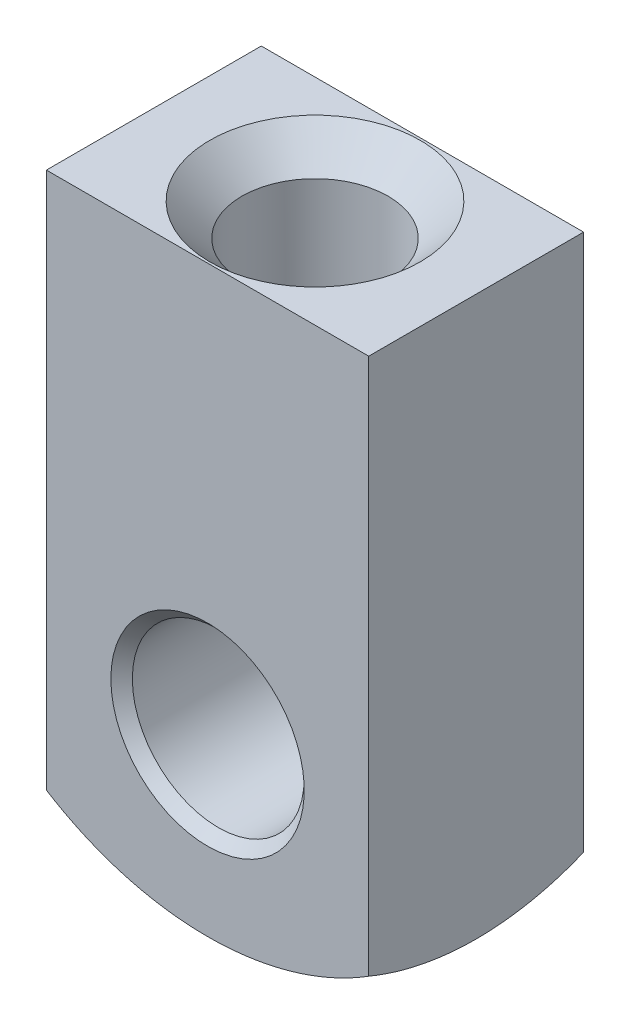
from build123d import *

# Parameters (mm, degrees)
ESQUISSE1_W             = 15
ESQUISSE1_H             = 28
BOSS_EXTRU_1_DEPTH      = 5
ESQUISSE4_R             = 4
ENL_V_MAT_EXTRU_1_DEPTH = 23.743130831
CHANFREIN1_SIZE         = 0.5
TROU_TARAUD_M81_D       = 6.8
TROU_TARAUD_M81_DEPTH   = 12
TROU_TARAUD_M81_TIP     = 2.042926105
CHANFREIN2_SIZE         = 1.5


with BuildPart() as part:
    # Esquisse1 → Boss.-Extru.1 (new, symmetric)
    with BuildSketch(Plane.XY):
        with Locations((0, 5)):
            Rectangle(ESQUISSE1_W, ESQUISSE1_H)
    extrude(amount=BOSS_EXTRU_1_DEPTH, both=True)

    # Esquisse3 → Enl_vement de mati_re-R_volution4 (revolve, cut)
    with BuildSketch(Plane.XY):
        with BuildLine():
            Line((0, -9), (0, -10))
            Line((0, -10), (10, -10))
            Line((10, -10), (10, -5.180339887))
            ThreePointArc((10, -5.180339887), (5.352331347, -8.012585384), (0, -9))
        make_face()
    revolve(axis=Axis((0, 8.219866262, 0), (0, -1, 0)), mode=Mode.SUBTRACT)

    # Esquisse4 → Enl_v. mat.-Extru.1 (cut, through all)
    with BuildSketch(Plane.XY.offset(5)):
        Circle(ESQUISSE4_R)
    extrude(amount=-ENL_V_MAT_EXTRU_1_DEPTH, mode=Mode.SUBTRACT)

    # Chanfrein1
    chanfrein1_edges = [part.edges().sort_by_distance(p)[0] for p in [
        (-4, 0, -5),
        (-4, 0, 5),
    ]]
    chamfer(chanfrein1_edges, length=CHANFREIN1_SIZE)

    # Trou taraud_ M81
    with Locations(Plane(origin=(0, 19, 0), x_dir=(1, 0, 0), z_dir=(0, 1, 0))):
        with Locations((0, 0)):
            Hole(TROU_TARAUD_M81_D / 2, depth=TROU_TARAUD_M81_DEPTH)
            with Locations((0, 0, -(TROU_TARAUD_M81_DEPTH + TROU_TARAUD_M81_TIP / 2))):  # 118° drill point
                Cone(0, TROU_TARAUD_M81_D / 2, TROU_TARAUD_M81_TIP, mode=Mode.SUBTRACT)

    # Chanfrein2
    chanfrein2_edges = [part.edges().sort_by_distance(p)[0] for p in [
        (3.4, 19, 0),
    ]]
    chamfer(chanfrein2_edges, length=CHANFREIN2_SIZE)


solid = part.part
